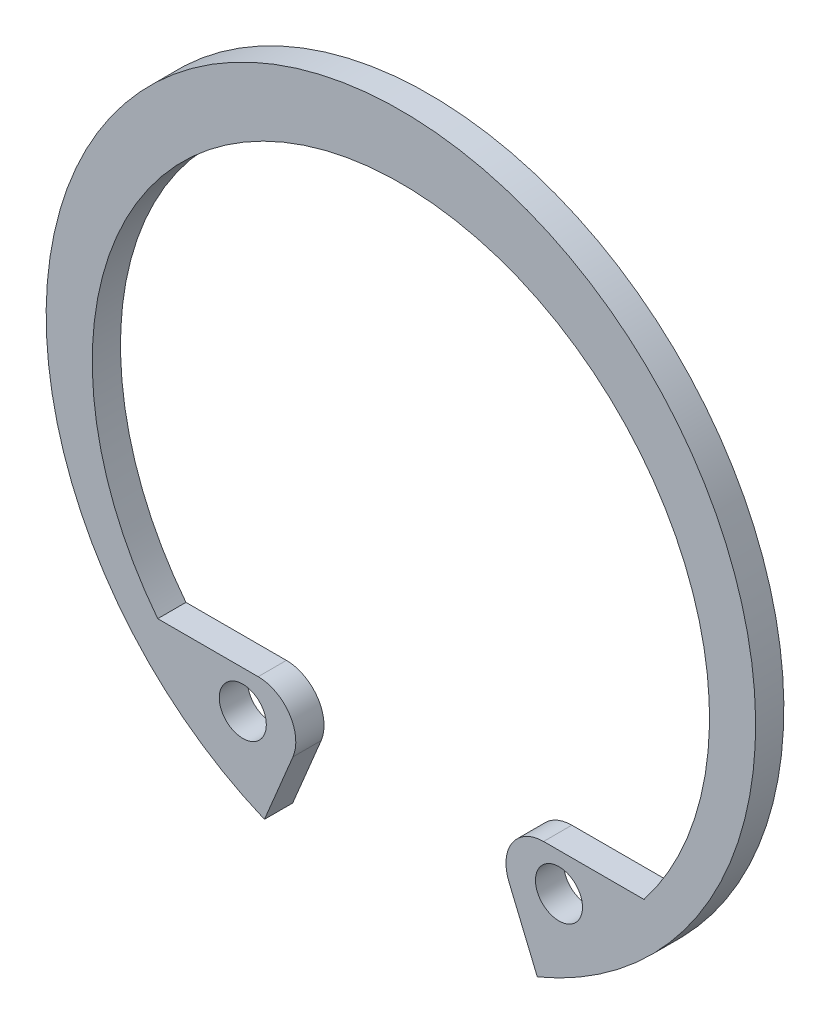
ISO-10303-21;
HEADER;
FILE_DESCRIPTION(('STEP AP214'),'2;1');
FILE_NAME('part.step','',(''),(''),'','','');
FILE_SCHEMA(('AUTOMOTIVE_DESIGN { 1 0 10303 214 1 1 1 1 }'));
ENDSEC;
DATA;
#1=APPLICATION_CONTEXT('core data for automotive mechanical design processes');
#2=APPLICATION_PROTOCOL_DEFINITION('international standard','automotive_design',2000,#1);
#3=PRODUCT_CONTEXT('',#1,'mechanical');
#4=PRODUCT('Part','Part','',(#3));
#5=PRODUCT_RELATED_PRODUCT_CATEGORY('part','',(#4));
#6=PRODUCT_DEFINITION_FORMATION('','',#4);
#7=PRODUCT_DEFINITION_CONTEXT('part definition',#1,'design');
#8=PRODUCT_DEFINITION('design','',#6,#7);
#9=PRODUCT_DEFINITION_SHAPE('','',#8);
#10=(LENGTH_UNIT() NAMED_UNIT(*) SI_UNIT(.MILLI.,.METRE.));
#11=(NAMED_UNIT(*) PLANE_ANGLE_UNIT() SI_UNIT($,.RADIAN.));
#12=(NAMED_UNIT(*) SI_UNIT($,.STERADIAN.) SOLID_ANGLE_UNIT());
#13=UNCERTAINTY_MEASURE_WITH_UNIT(LENGTH_MEASURE(1.E-05),#10,'distance_accuracy_value','');
#14=(GEOMETRIC_REPRESENTATION_CONTEXT(3) GLOBAL_UNCERTAINTY_ASSIGNED_CONTEXT((#13)) GLOBAL_UNIT_ASSIGNED_CONTEXT((#10,
#11,#12)) REPRESENTATION_CONTEXT('',''));
#15=CARTESIAN_POINT('',(0.,0.,0.));
#16=DIRECTION('',(0.,0.,1.));
#17=DIRECTION('',(1.,0.,0.));
#18=AXIS2_PLACEMENT_3D('',#15,#16,#17);
#19=CARTESIAN_POINT('',(0.,-0.9,1.5));
#20=DIRECTION('',(0.,0.,1.));
#21=DIRECTION('',(1.,0.,0.));
#22=AXIS2_PLACEMENT_3D('',#19,#20,#21);
#23=PLANE('',#22);
#24=CARTESIAN_POINT('',(8.4,-13.,1.5));
#25=DIRECTION('',(0.,0.,1.));
#26=DIRECTION('',(1.,0.,0.));
#27=AXIS2_PLACEMENT_3D('',#24,#25,#26);
#28=CIRCLE('',#27,1.25);
#29=CARTESIAN_POINT('',(9.65,-13.,1.5));
#30=VERTEX_POINT('',#29);
#31=EDGE_CURVE('E146',#30,#30,#28,.T.);
#32=ORIENTED_EDGE('',*,*,#31,.F.);
#33=EDGE_LOOP('',(#32));
#34=FACE_BOUND('',#33,.T.);
#35=CARTESIAN_POINT('',(0.,-0.9,1.5));
#36=DIRECTION('',(0.,0.,-1.));
#37=DIRECTION('',(1.,0.,0.));
#38=AXIS2_PLACEMENT_3D('',#35,#36,#37);
#39=CIRCLE('',#38,16.4);
#40=CARTESIAN_POINT('',(-12.9209132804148,-11.,1.5));
#41=VERTEX_POINT('',#40);
#42=CARTESIAN_POINT('',(12.9209132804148,-11.,1.5));
#43=VERTEX_POINT('',#42);
#44=EDGE_CURVE('E162',#41,#43,#39,.T.);
#45=ORIENTED_EDGE('',*,*,#44,.T.);
#46=DIRECTION('',(-1.,0.,0.));
#47=VECTOR('',#46,1.);
#48=CARTESIAN_POINT('',(7.58333333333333,-11.,1.5));
#49=LINE('',#48,#47);
#50=CARTESIAN_POINT('',(7.58333333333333,-11.,1.5));
#51=VERTEX_POINT('',#50);
#52=EDGE_CURVE('E101',#43,#51,#49,.T.);
#53=ORIENTED_EDGE('',*,*,#52,.T.);
#54=CARTESIAN_POINT('',(7.58333333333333,-13.,1.5));
#55=DIRECTION('',(0.,0.,1.));
#56=DIRECTION('',(-1.,0.,0.));
#57=AXIS2_PLACEMENT_3D('',#54,#55,#56);
#58=CIRCLE('',#57,2.);
#59=CARTESIAN_POINT('',(5.73717948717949,-13.7692307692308,1.5));
#60=VERTEX_POINT('',#59);
#61=EDGE_CURVE('E181',#51,#60,#58,.T.);
#62=ORIENTED_EDGE('',*,*,#61,.T.);
#63=DIRECTION('',(0.384615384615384,-0.923076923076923,0.));
#64=VECTOR('',#63,1.);
#65=CARTESIAN_POINT('',(7.25,-17.4,1.5));
#66=LINE('',#65,#64);
#67=CARTESIAN_POINT('',(7.25,-17.4,1.5));
#68=VERTEX_POINT('',#67);
#69=EDGE_CURVE('E194',#60,#68,#66,.T.);
#70=ORIENTED_EDGE('',*,*,#69,.T.);
#71=CARTESIAN_POINT('',(0.,0.,1.5));
#72=DIRECTION('',(0.,0.,1.));
#73=DIRECTION('',(1.,0.,0.));
#74=AXIS2_PLACEMENT_3D('',#71,#72,#73);
#75=CIRCLE('',#74,18.85);
#76=CARTESIAN_POINT('',(-7.25,-17.4,1.5));
#77=VERTEX_POINT('',#76);
#78=EDGE_CURVE('E121',#68,#77,#75,.T.);
#79=ORIENTED_EDGE('',*,*,#78,.T.);
#80=DIRECTION('',(0.384615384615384,0.923076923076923,0.));
#81=VECTOR('',#80,1.);
#82=CARTESIAN_POINT('',(-7.25,-17.4,1.5));
#83=LINE('',#82,#81);
#84=CARTESIAN_POINT('',(-5.73717948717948,-13.7692307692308,1.5));
#85=VERTEX_POINT('',#84);
#86=EDGE_CURVE('E115',#77,#85,#83,.T.);
#87=ORIENTED_EDGE('',*,*,#86,.T.);
#88=CARTESIAN_POINT('',(-7.58333333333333,-13.,1.5));
#89=DIRECTION('',(0.,0.,1.));
#90=DIRECTION('',(1.,0.,0.));
#91=AXIS2_PLACEMENT_3D('',#88,#89,#90);
#92=CIRCLE('',#91,2.);
#93=CARTESIAN_POINT('',(-7.58333333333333,-11.,1.5));
#94=VERTEX_POINT('',#93);
#95=EDGE_CURVE('E119',#85,#94,#92,.T.);
#96=ORIENTED_EDGE('',*,*,#95,.T.);
#97=DIRECTION('',(-1.,0.,0.));
#98=VECTOR('',#97,1.);
#99=CARTESIAN_POINT('',(-12.9209132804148,-11.,1.5));
#100=LINE('',#99,#98);
#101=EDGE_CURVE('E54',#94,#41,#100,.T.);
#102=ORIENTED_EDGE('',*,*,#101,.T.);
#103=EDGE_LOOP('',(#45,#53,#62,#70,#79,#87,#96,#102));
#104=FACE_BOUND('',#103,.T.);
#105=CARTESIAN_POINT('',(-8.4,-13.,1.5));
#106=DIRECTION('',(0.,0.,1.));
#107=DIRECTION('',(1.,0.,0.));
#108=AXIS2_PLACEMENT_3D('',#105,#106,#107);
#109=CIRCLE('',#108,1.25);
#110=CARTESIAN_POINT('',(-7.15,-13.,1.5));
#111=VERTEX_POINT('',#110);
#112=EDGE_CURVE('E205',#111,#111,#109,.T.);
#113=ORIENTED_EDGE('',*,*,#112,.F.);
#114=EDGE_LOOP('',(#113));
#115=FACE_BOUND('',#114,.T.);
#116=ADVANCED_FACE('F37',(#34,#104,#115),#23,.T.);
#117=CARTESIAN_POINT('',(0.,-0.9,0.));
#118=DIRECTION('',(0.,0.,1.));
#119=DIRECTION('',(1.,0.,0.));
#120=AXIS2_PLACEMENT_3D('',#117,#118,#119);
#121=PLANE('',#120);
#122=CARTESIAN_POINT('',(8.4,-13.,0.));
#123=DIRECTION('',(0.,0.,1.));
#124=DIRECTION('',(1.,0.,0.));
#125=AXIS2_PLACEMENT_3D('',#122,#123,#124);
#126=CIRCLE('',#125,1.25);
#127=CARTESIAN_POINT('',(9.65,-13.,0.));
#128=VERTEX_POINT('',#127);
#129=EDGE_CURVE('E201',#128,#128,#126,.T.);
#130=ORIENTED_EDGE('',*,*,#129,.T.);
#131=EDGE_LOOP('',(#130));
#132=FACE_BOUND('',#131,.T.);
#133=CARTESIAN_POINT('',(0.,-0.9,0.));
#134=DIRECTION('',(0.,0.,-1.));
#135=DIRECTION('',(1.,0.,0.));
#136=AXIS2_PLACEMENT_3D('',#133,#134,#135);
#137=CIRCLE('',#136,16.4);
#138=CARTESIAN_POINT('',(-12.9209132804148,-11.,0.));
#139=VERTEX_POINT('',#138);
#140=CARTESIAN_POINT('',(12.9209132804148,-11.,0.));
#141=VERTEX_POINT('',#140);
#142=EDGE_CURVE('E142',#139,#141,#137,.T.);
#143=ORIENTED_EDGE('',*,*,#142,.F.);
#144=DIRECTION('',(-1.,0.,0.));
#145=VECTOR('',#144,1.);
#146=CARTESIAN_POINT('',(-12.9209132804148,-11.,0.));
#147=LINE('',#146,#145);
#148=CARTESIAN_POINT('',(-7.58333333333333,-11.,0.));
#149=VERTEX_POINT('',#148);
#150=EDGE_CURVE('E93',#149,#139,#147,.T.);
#151=ORIENTED_EDGE('',*,*,#150,.F.);
#152=CARTESIAN_POINT('',(-7.58333333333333,-13.,0.));
#153=DIRECTION('',(0.,0.,1.));
#154=DIRECTION('',(1.,0.,0.));
#155=AXIS2_PLACEMENT_3D('',#152,#153,#154);
#156=CIRCLE('',#155,2.);
#157=CARTESIAN_POINT('',(-5.73717948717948,-13.7692307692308,0.));
#158=VERTEX_POINT('',#157);
#159=EDGE_CURVE('E87',#158,#149,#156,.T.);
#160=ORIENTED_EDGE('',*,*,#159,.F.);
#161=DIRECTION('',(0.384615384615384,0.923076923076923,0.));
#162=VECTOR('',#161,1.);
#163=CARTESIAN_POINT('',(-7.25,-17.4,0.));
#164=LINE('',#163,#162);
#165=CARTESIAN_POINT('',(-7.25,-17.4,0.));
#166=VERTEX_POINT('',#165);
#167=EDGE_CURVE('E129',#166,#158,#164,.T.);
#168=ORIENTED_EDGE('',*,*,#167,.F.);
#169=CARTESIAN_POINT('',(0.,0.,0.));
#170=DIRECTION('',(0.,0.,1.));
#171=DIRECTION('',(1.,0.,0.));
#172=AXIS2_PLACEMENT_3D('',#169,#170,#171);
#173=CIRCLE('',#172,18.85);
#174=CARTESIAN_POINT('',(7.25,-17.4,0.));
#175=VERTEX_POINT('',#174);
#176=EDGE_CURVE('E155',#175,#166,#173,.T.);
#177=ORIENTED_EDGE('',*,*,#176,.F.);
#178=DIRECTION('',(0.384615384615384,-0.923076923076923,0.));
#179=VECTOR('',#178,1.);
#180=CARTESIAN_POINT('',(7.25,-17.4,0.));
#181=LINE('',#180,#179);
#182=CARTESIAN_POINT('',(5.73717948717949,-13.7692307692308,0.));
#183=VERTEX_POINT('',#182);
#184=EDGE_CURVE('E152',#183,#175,#181,.T.);
#185=ORIENTED_EDGE('',*,*,#184,.F.);
#186=CARTESIAN_POINT('',(7.58333333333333,-13.,0.));
#187=DIRECTION('',(0.,0.,1.));
#188=DIRECTION('',(-1.,0.,0.));
#189=AXIS2_PLACEMENT_3D('',#186,#187,#188);
#190=CIRCLE('',#189,2.);
#191=CARTESIAN_POINT('',(7.58333333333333,-11.,0.));
#192=VERTEX_POINT('',#191);
#193=EDGE_CURVE('E149',#192,#183,#190,.T.);
#194=ORIENTED_EDGE('',*,*,#193,.F.);
#195=DIRECTION('',(-1.,0.,0.));
#196=VECTOR('',#195,1.);
#197=CARTESIAN_POINT('',(7.58333333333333,-11.,0.));
#198=LINE('',#197,#196);
#199=EDGE_CURVE('E145',#141,#192,#198,.T.);
#200=ORIENTED_EDGE('',*,*,#199,.F.);
#201=EDGE_LOOP('',(#143,#151,#160,#168,#177,#185,#194,#200));
#202=FACE_BOUND('',#201,.T.);
#203=CARTESIAN_POINT('',(-8.4,-13.,0.));
#204=DIRECTION('',(0.,0.,1.));
#205=DIRECTION('',(1.,0.,0.));
#206=AXIS2_PLACEMENT_3D('',#203,#204,#205);
#207=CIRCLE('',#206,1.25);
#208=CARTESIAN_POINT('',(-7.15,-13.,0.));
#209=VERTEX_POINT('',#208);
#210=EDGE_CURVE('E208',#209,#209,#207,.T.);
#211=ORIENTED_EDGE('',*,*,#210,.T.);
#212=EDGE_LOOP('',(#211));
#213=FACE_BOUND('',#212,.T.);
#214=ADVANCED_FACE('F185',(#132,#202,#213),#121,.F.);
#215=CARTESIAN_POINT('',(0.,-0.9,1.5));
#216=DIRECTION('',(0.,0.,-1.));
#217=DIRECTION('',(-1.,0.,0.));
#218=AXIS2_PLACEMENT_3D('',#215,#216,#217);
#219=CYLINDRICAL_SURFACE('',#218,16.4);
#220=ORIENTED_EDGE('',*,*,#142,.T.);
#221=DIRECTION('',(0.,0.,-1.));
#222=VECTOR('',#221,1.);
#223=CARTESIAN_POINT('',(12.9209132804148,-11.,1.5));
#224=LINE('',#223,#222);
#225=EDGE_CURVE('E11',#43,#141,#224,.T.);
#226=ORIENTED_EDGE('',*,*,#225,.F.);
#227=ORIENTED_EDGE('',*,*,#44,.F.);
#228=DIRECTION('',(0.,0.,-1.));
#229=VECTOR('',#228,1.);
#230=CARTESIAN_POINT('',(-12.9209132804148,-11.,1.5));
#231=LINE('',#230,#229);
#232=EDGE_CURVE('E138',#41,#139,#231,.T.);
#233=ORIENTED_EDGE('',*,*,#232,.T.);
#234=EDGE_LOOP('',(#220,#226,#227,#233));
#235=FACE_BOUND('',#234,.T.);
#236=ADVANCED_FACE('F39',(#235),#219,.F.);
#237=CARTESIAN_POINT('',(7.58333333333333,-11.,1.5));
#238=DIRECTION('',(0.,-1.,0.));
#239=DIRECTION('',(0.,0.,-1.));
#240=AXIS2_PLACEMENT_3D('',#237,#238,#239);
#241=PLANE('',#240);
#242=ORIENTED_EDGE('',*,*,#199,.T.);
#243=DIRECTION('',(0.,0.,-1.));
#244=VECTOR('',#243,1.);
#245=CARTESIAN_POINT('',(7.58333333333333,-11.,1.5));
#246=LINE('',#245,#244);
#247=EDGE_CURVE('E46',#51,#192,#246,.T.);
#248=ORIENTED_EDGE('',*,*,#247,.F.);
#249=ORIENTED_EDGE('',*,*,#52,.F.);
#250=ORIENTED_EDGE('',*,*,#225,.T.);
#251=EDGE_LOOP('',(#242,#248,#249,#250));
#252=FACE_BOUND('',#251,.T.);
#253=ADVANCED_FACE('F242',(#252),#241,.F.);
#254=CARTESIAN_POINT('',(7.58333333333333,-13.,1.5));
#255=DIRECTION('',(0.,0.,-1.));
#256=DIRECTION('',(-1.,0.,0.));
#257=AXIS2_PLACEMENT_3D('',#254,#255,#256);
#258=CYLINDRICAL_SURFACE('',#257,2.);
#259=ORIENTED_EDGE('',*,*,#193,.T.);
#260=DIRECTION('',(0.,0.,-1.));
#261=VECTOR('',#260,1.);
#262=CARTESIAN_POINT('',(5.73717948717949,-13.7692307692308,1.5));
#263=LINE('',#262,#261);
#264=EDGE_CURVE('E170',#60,#183,#263,.T.);
#265=ORIENTED_EDGE('',*,*,#264,.F.);
#266=ORIENTED_EDGE('',*,*,#61,.F.);
#267=ORIENTED_EDGE('',*,*,#247,.T.);
#268=EDGE_LOOP('',(#259,#265,#266,#267));
#269=FACE_BOUND('',#268,.T.);
#270=ADVANCED_FACE('F179',(#269),#258,.T.);
#271=CARTESIAN_POINT('',(7.25,-17.4,1.5));
#272=DIRECTION('',(0.923076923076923,0.384615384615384,0.));
#273=DIRECTION('',(-0.384615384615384,0.923076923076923,0.));
#274=AXIS2_PLACEMENT_3D('',#271,#272,#273);
#275=PLANE('',#274);
#276=ORIENTED_EDGE('',*,*,#184,.T.);
#277=DIRECTION('',(0.,0.,-1.));
#278=VECTOR('',#277,1.);
#279=CARTESIAN_POINT('',(7.25,-17.4,1.5));
#280=LINE('',#279,#278);
#281=EDGE_CURVE('E167',#68,#175,#280,.T.);
#282=ORIENTED_EDGE('',*,*,#281,.F.);
#283=ORIENTED_EDGE('',*,*,#69,.F.);
#284=ORIENTED_EDGE('',*,*,#264,.T.);
#285=EDGE_LOOP('',(#276,#282,#283,#284));
#286=FACE_BOUND('',#285,.T.);
#287=ADVANCED_FACE('F190',(#286),#275,.F.);
#288=CARTESIAN_POINT('',(0.,0.,1.5));
#289=DIRECTION('',(0.,0.,-1.));
#290=DIRECTION('',(-1.,0.,0.));
#291=AXIS2_PLACEMENT_3D('',#288,#289,#290);
#292=CYLINDRICAL_SURFACE('',#291,18.85);
#293=ORIENTED_EDGE('',*,*,#176,.T.);
#294=DIRECTION('',(0.,0.,-1.));
#295=VECTOR('',#294,1.);
#296=CARTESIAN_POINT('',(-7.25,-17.4,1.5));
#297=LINE('',#296,#295);
#298=EDGE_CURVE('E130',#77,#166,#297,.T.);
#299=ORIENTED_EDGE('',*,*,#298,.F.);
#300=ORIENTED_EDGE('',*,*,#78,.F.);
#301=ORIENTED_EDGE('',*,*,#281,.T.);
#302=EDGE_LOOP('',(#293,#299,#300,#301));
#303=FACE_BOUND('',#302,.T.);
#304=ADVANCED_FACE('F193',(#303),#292,.T.);
#305=CARTESIAN_POINT('',(-7.25,-17.4,1.5));
#306=DIRECTION('',(-0.923076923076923,0.384615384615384,0.));
#307=DIRECTION('',(-0.384615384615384,-0.923076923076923,0.));
#308=AXIS2_PLACEMENT_3D('',#305,#306,#307);
#309=PLANE('',#308);
#310=ORIENTED_EDGE('',*,*,#167,.T.);
#311=DIRECTION('',(0.,0.,-1.));
#312=VECTOR('',#311,1.);
#313=CARTESIAN_POINT('',(-5.73717948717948,-13.7692307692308,1.5));
#314=LINE('',#313,#312);
#315=EDGE_CURVE('E126',#85,#158,#314,.T.);
#316=ORIENTED_EDGE('',*,*,#315,.F.);
#317=ORIENTED_EDGE('',*,*,#86,.F.);
#318=ORIENTED_EDGE('',*,*,#298,.T.);
#319=EDGE_LOOP('',(#310,#316,#317,#318));
#320=FACE_BOUND('',#319,.T.);
#321=ADVANCED_FACE('F127',(#320),#309,.F.);
#322=CARTESIAN_POINT('',(-7.58333333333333,-13.,1.5));
#323=DIRECTION('',(0.,0.,-1.));
#324=DIRECTION('',(-1.,0.,0.));
#325=AXIS2_PLACEMENT_3D('',#322,#323,#324);
#326=CYLINDRICAL_SURFACE('',#325,2.);
#327=ORIENTED_EDGE('',*,*,#159,.T.);
#328=DIRECTION('',(0.,0.,-1.));
#329=VECTOR('',#328,1.);
#330=CARTESIAN_POINT('',(-7.58333333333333,-11.,1.5));
#331=LINE('',#330,#329);
#332=EDGE_CURVE('E131',#94,#149,#331,.T.);
#333=ORIENTED_EDGE('',*,*,#332,.F.);
#334=ORIENTED_EDGE('',*,*,#95,.F.);
#335=ORIENTED_EDGE('',*,*,#315,.T.);
#336=EDGE_LOOP('',(#327,#333,#334,#335));
#337=FACE_BOUND('',#336,.T.);
#338=ADVANCED_FACE('F133',(#337),#326,.T.);
#339=CARTESIAN_POINT('',(-12.9209132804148,-11.,1.5));
#340=DIRECTION('',(0.,-1.,0.));
#341=DIRECTION('',(1.,0.,0.));
#342=AXIS2_PLACEMENT_3D('',#339,#340,#341);
#343=PLANE('',#342);
#344=ORIENTED_EDGE('',*,*,#150,.T.);
#345=ORIENTED_EDGE('',*,*,#232,.F.);
#346=ORIENTED_EDGE('',*,*,#101,.F.);
#347=ORIENTED_EDGE('',*,*,#332,.T.);
#348=EDGE_LOOP('',(#344,#345,#346,#347));
#349=FACE_BOUND('',#348,.T.);
#350=ADVANCED_FACE('F230',(#349),#343,.F.);
#351=CARTESIAN_POINT('',(8.4,-13.,1.5));
#352=DIRECTION('',(0.,0.,-1.));
#353=DIRECTION('',(-1.,0.,0.));
#354=AXIS2_PLACEMENT_3D('',#351,#352,#353);
#355=CYLINDRICAL_SURFACE('',#354,1.25);
#356=ORIENTED_EDGE('',*,*,#31,.T.);
#357=EDGE_LOOP('',(#356));
#358=FACE_BOUND('',#357,.T.);
#359=ORIENTED_EDGE('',*,*,#129,.F.);
#360=EDGE_LOOP('',(#359));
#361=FACE_BOUND('',#360,.T.);
#362=ADVANCED_FACE('F227',(#358,#361),#355,.F.);
#363=CARTESIAN_POINT('',(-8.4,-13.,1.5));
#364=DIRECTION('',(0.,0.,-1.));
#365=DIRECTION('',(-1.,0.,0.));
#366=AXIS2_PLACEMENT_3D('',#363,#364,#365);
#367=CYLINDRICAL_SURFACE('',#366,1.25);
#368=ORIENTED_EDGE('',*,*,#112,.T.);
#369=EDGE_LOOP('',(#368));
#370=FACE_BOUND('',#369,.T.);
#371=ORIENTED_EDGE('',*,*,#210,.F.);
#372=EDGE_LOOP('',(#371));
#373=FACE_BOUND('',#372,.T.);
#374=ADVANCED_FACE('F215',(#370,#373),#367,.F.);
#375=CLOSED_SHELL('',(#116,#214,#236,#253,#270,#287,#304,#321,#338,#350,#362,#374));
#376=MANIFOLD_SOLID_BREP('B2',#375);
#377=ADVANCED_BREP_SHAPE_REPRESENTATION('',(#18,#376),#14);
#378=SHAPE_DEFINITION_REPRESENTATION(#9,#377);
ENDSEC;
END-ISO-10303-21;
